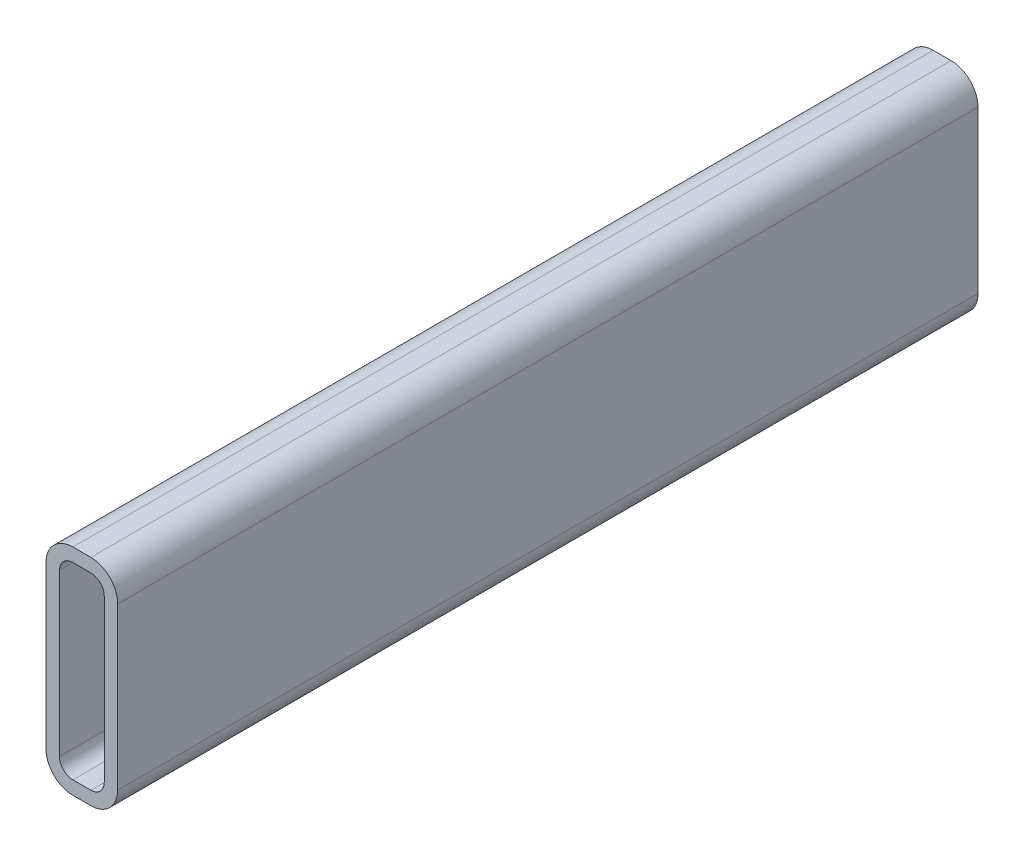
from build123d import *

# Parameters (mm, degrees)
BOSS_EXTRUDE1_DEPTH = 304.8


with BuildPart() as part:
    # Sketch1 → Boss-Extrude1 (new body)
    with BuildSketch(Plane.XY):
        with BuildLine():
            Line((9.525, 76.2), (15.875, 76.2))
            ThreePointArc((15.875, 76.2), (22.610192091, 73.410192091), (25.4, 66.675))
            Line((25.4, 66.675), (25.4, 9.525))
            ThreePointArc((25.4, 9.525), (22.610192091, 2.789807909), (15.875, 0))
            Line((15.875, 0), (9.525, 0))
            ThreePointArc((9.525, 0), (2.789807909, 2.789807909), (0, 9.525))
            Line((0, 9.525), (0, 66.675))
            ThreePointArc((0, 66.675), (2.789807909, 73.410192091), (9.525, 76.2))
        make_face()
        with BuildLine():
            Line((9.525, 71.4375), (15.875, 71.4375))
            ThreePointArc((15.875, 71.4375), (19.242596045, 70.042596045), (20.6375, 66.675))
            Line((20.6375, 66.675), (20.6375, 9.525))
            ThreePointArc((20.6375, 9.525), (19.242596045, 6.157403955), (15.875, 4.7625))
            Line((15.875, 4.7625), (9.525, 4.7625))
            ThreePointArc((9.525, 4.7625), (6.157403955, 6.157403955), (4.7625, 9.525))
            Line((4.7625, 9.525), (4.7625, 66.675))
            ThreePointArc((4.7625, 66.675), (6.157403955, 70.042596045), (9.525, 71.4375))
        make_face(mode=Mode.SUBTRACT)
    extrude(amount=BOSS_EXTRUDE1_DEPTH)


solid = part.part
